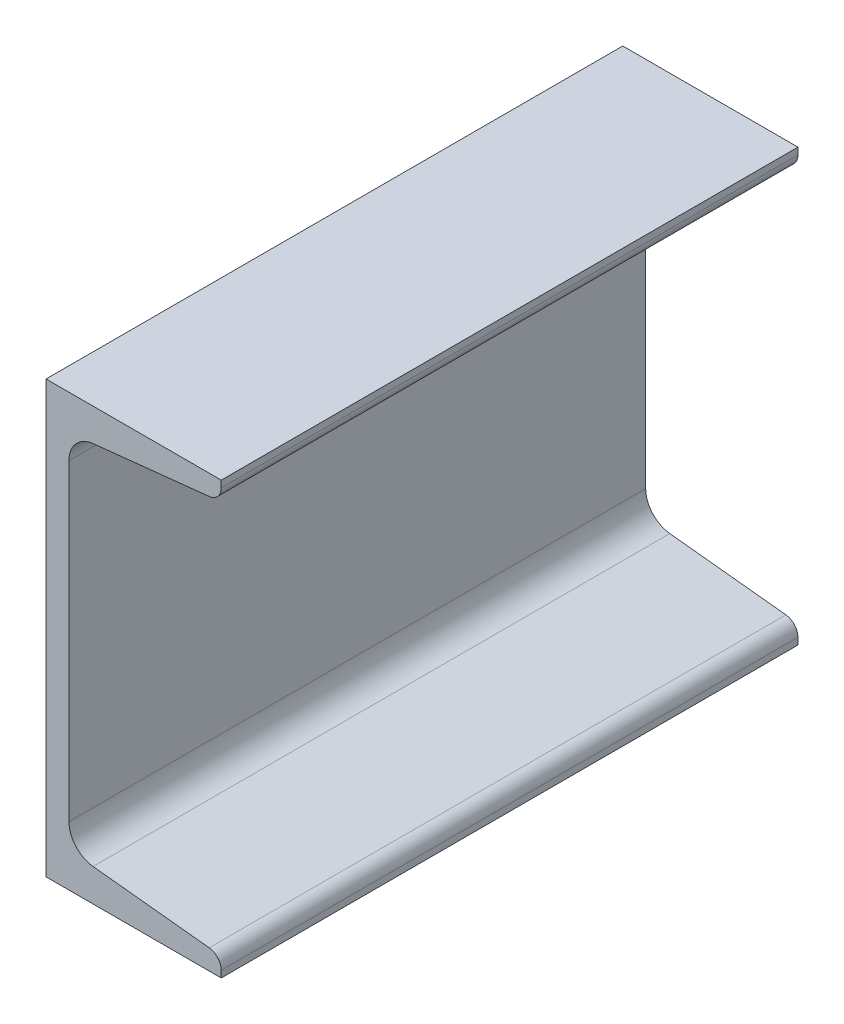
ISO-10303-21;
HEADER;
FILE_DESCRIPTION(('STEP AP214'),'2;1');
FILE_NAME('part.step','',(''),(''),'','','');
FILE_SCHEMA(('AUTOMOTIVE_DESIGN { 1 0 10303 214 1 1 1 1 }'));
ENDSEC;
DATA;
#1=APPLICATION_CONTEXT('core data for automotive mechanical design processes');
#2=APPLICATION_PROTOCOL_DEFINITION('international standard','automotive_design',2000,#1);
#3=PRODUCT_CONTEXT('',#1,'mechanical');
#4=PRODUCT('Part','Part','',(#3));
#5=PRODUCT_RELATED_PRODUCT_CATEGORY('part','',(#4));
#6=PRODUCT_DEFINITION_FORMATION('','',#4);
#7=PRODUCT_DEFINITION_CONTEXT('part definition',#1,'design');
#8=PRODUCT_DEFINITION('design','',#6,#7);
#9=PRODUCT_DEFINITION_SHAPE('','',#8);
#10=(LENGTH_UNIT() NAMED_UNIT(*) SI_UNIT(.MILLI.,.METRE.));
#11=(NAMED_UNIT(*) PLANE_ANGLE_UNIT() SI_UNIT($,.RADIAN.));
#12=(NAMED_UNIT(*) SI_UNIT($,.STERADIAN.) SOLID_ANGLE_UNIT());
#13=UNCERTAINTY_MEASURE_WITH_UNIT(LENGTH_MEASURE(1.E-05),#10,'distance_accuracy_value','');
#14=(GEOMETRIC_REPRESENTATION_CONTEXT(3) GLOBAL_UNCERTAINTY_ASSIGNED_CONTEXT((#13)) GLOBAL_UNIT_ASSIGNED_CONTEXT((#10,
#11,#12)) REPRESENTATION_CONTEXT('',''));
#15=CARTESIAN_POINT('',(0.,0.,0.));
#16=DIRECTION('',(0.,0.,1.));
#17=DIRECTION('',(1.,0.,0.));
#18=AXIS2_PLACEMENT_3D('',#15,#16,#17);
#19=CARTESIAN_POINT('',(65.,80.,214.));
#20=DIRECTION('',(0.,-1.,0.));
#21=DIRECTION('',(1.,0.,0.));
#22=AXIS2_PLACEMENT_3D('',#19,#20,#21);
#23=PLANE('',#22);
#24=DIRECTION('',(-1.,0.,0.));
#25=VECTOR('',#24,1.);
#26=CARTESIAN_POINT('',(65.,80.,0.));
#27=LINE('',#26,#25);
#28=CARTESIAN_POINT('',(65.,80.,0.));
#29=VERTEX_POINT('',#28);
#30=CARTESIAN_POINT('',(0.,80.,0.));
#31=VERTEX_POINT('',#30);
#32=EDGE_CURVE('E159',#29,#31,#27,.T.);
#33=ORIENTED_EDGE('',*,*,#32,.T.);
#34=DIRECTION('',(0.,0.,-1.));
#35=VECTOR('',#34,1.);
#36=CARTESIAN_POINT('',(0.,80.,214.));
#37=LINE('',#36,#35);
#38=CARTESIAN_POINT('',(0.,80.,214.));
#39=VERTEX_POINT('',#38);
#40=EDGE_CURVE('E11',#39,#31,#37,.T.);
#41=ORIENTED_EDGE('',*,*,#40,.F.);
#42=DIRECTION('',(-1.,0.,0.));
#43=VECTOR('',#42,1.);
#44=CARTESIAN_POINT('',(65.,80.,214.));
#45=LINE('',#44,#43);
#46=CARTESIAN_POINT('',(65.,80.,214.));
#47=VERTEX_POINT('',#46);
#48=EDGE_CURVE('E181',#47,#39,#45,.T.);
#49=ORIENTED_EDGE('',*,*,#48,.F.);
#50=DIRECTION('',(0.,0.,-1.));
#51=VECTOR('',#50,1.);
#52=CARTESIAN_POINT('',(65.,80.,214.));
#53=LINE('',#52,#51);
#54=EDGE_CURVE('E155',#47,#29,#53,.T.);
#55=ORIENTED_EDGE('',*,*,#54,.T.);
#56=EDGE_LOOP('',(#33,#41,#49,#55));
#57=FACE_BOUND('',#56,.T.);
#58=ADVANCED_FACE('F39',(#57),#23,.F.);
#59=CARTESIAN_POINT('',(0.,80.,214.));
#60=DIRECTION('',(1.,0.,0.));
#61=DIRECTION('',(0.,1.,0.));
#62=AXIS2_PLACEMENT_3D('',#59,#60,#61);
#63=PLANE('',#62);
#64=DIRECTION('',(0.,-1.,0.));
#65=VECTOR('',#64,1.);
#66=CARTESIAN_POINT('',(0.,80.,0.));
#67=LINE('',#66,#65);
#68=CARTESIAN_POINT('',(0.,-80.,0.));
#69=VERTEX_POINT('',#68);
#70=EDGE_CURVE('E162',#31,#69,#67,.T.);
#71=ORIENTED_EDGE('',*,*,#70,.T.);
#72=DIRECTION('',(0.,0.,-1.));
#73=VECTOR('',#72,1.);
#74=CARTESIAN_POINT('',(0.,-80.,214.));
#75=LINE('',#74,#73);
#76=CARTESIAN_POINT('',(0.,-80.,214.));
#77=VERTEX_POINT('',#76);
#78=EDGE_CURVE('E47',#77,#69,#75,.T.);
#79=ORIENTED_EDGE('',*,*,#78,.F.);
#80=DIRECTION('',(0.,-1.,0.));
#81=VECTOR('',#80,1.);
#82=CARTESIAN_POINT('',(0.,80.,214.));
#83=LINE('',#82,#81);
#84=EDGE_CURVE('E110',#39,#77,#83,.T.);
#85=ORIENTED_EDGE('',*,*,#84,.F.);
#86=ORIENTED_EDGE('',*,*,#40,.T.);
#87=EDGE_LOOP('',(#71,#79,#85,#86));
#88=FACE_BOUND('',#87,.T.);
#89=ADVANCED_FACE('F259',(#88),#63,.F.);
#90=CARTESIAN_POINT('',(0.,-80.,214.));
#91=DIRECTION('',(0.,1.,0.));
#92=DIRECTION('',(0.,0.,1.));
#93=AXIS2_PLACEMENT_3D('',#90,#91,#92);
#94=PLANE('',#93);
#95=DIRECTION('',(1.,0.,0.));
#96=VECTOR('',#95,1.);
#97=CARTESIAN_POINT('',(0.,-80.,0.));
#98=LINE('',#97,#96);
#99=CARTESIAN_POINT('',(65.,-80.,0.));
#100=VERTEX_POINT('',#99);
#101=EDGE_CURVE('E164',#69,#100,#98,.T.);
#102=ORIENTED_EDGE('',*,*,#101,.T.);
#103=DIRECTION('',(0.,0.,-1.));
#104=VECTOR('',#103,1.);
#105=CARTESIAN_POINT('',(65.,-80.,214.));
#106=LINE('',#105,#104);
#107=CARTESIAN_POINT('',(65.,-80.,214.));
#108=VERTEX_POINT('',#107);
#109=EDGE_CURVE('E200',#108,#100,#106,.T.);
#110=ORIENTED_EDGE('',*,*,#109,.F.);
#111=DIRECTION('',(1.,0.,0.));
#112=VECTOR('',#111,1.);
#113=CARTESIAN_POINT('',(0.,-80.,214.));
#114=LINE('',#113,#112);
#115=EDGE_CURVE('E208',#77,#108,#114,.T.);
#116=ORIENTED_EDGE('',*,*,#115,.F.);
#117=ORIENTED_EDGE('',*,*,#78,.T.);
#118=EDGE_LOOP('',(#102,#110,#116,#117));
#119=FACE_BOUND('',#118,.T.);
#120=ADVANCED_FACE('F206',(#119),#94,.F.);
#121=CARTESIAN_POINT('',(65.,-80.,214.));
#122=DIRECTION('',(-1.,0.,0.));
#123=DIRECTION('',(0.,0.,1.));
#124=AXIS2_PLACEMENT_3D('',#121,#122,#123);
#125=PLANE('',#124);
#126=DIRECTION('',(0.,1.,0.));
#127=VECTOR('',#126,1.);
#128=CARTESIAN_POINT('',(65.,-80.,0.));
#129=LINE('',#128,#127);
#130=CARTESIAN_POINT('',(65.,-77.4971407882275,0.));
#131=VERTEX_POINT('',#130);
#132=EDGE_CURVE('E166',#100,#131,#129,.T.);
#133=ORIENTED_EDGE('',*,*,#132,.T.);
#134=DIRECTION('',(0.,0.,-1.));
#135=VECTOR('',#134,1.);
#136=CARTESIAN_POINT('',(65.,-77.4971407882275,214.));
#137=LINE('',#136,#135);
#138=CARTESIAN_POINT('',(65.,-77.4971407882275,214.));
#139=VERTEX_POINT('',#138);
#140=EDGE_CURVE('E197',#139,#131,#137,.T.);
#141=ORIENTED_EDGE('',*,*,#140,.F.);
#142=DIRECTION('',(0.,1.,0.));
#143=VECTOR('',#142,1.);
#144=CARTESIAN_POINT('',(65.,-80.,214.));
#145=LINE('',#144,#143);
#146=EDGE_CURVE('E226',#108,#139,#145,.T.);
#147=ORIENTED_EDGE('',*,*,#146,.F.);
#148=ORIENTED_EDGE('',*,*,#109,.T.);
#149=EDGE_LOOP('',(#133,#141,#147,#148));
#150=FACE_BOUND('',#149,.T.);
#151=ADVANCED_FACE('F217',(#150),#125,.F.);
#152=CARTESIAN_POINT('',(60.,-77.4971407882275,214.));
#153=DIRECTION('',(0.,0.,-1.));
#154=DIRECTION('',(-1.,0.,0.));
#155=AXIS2_PLACEMENT_3D('',#152,#153,#154);
#156=CYLINDRICAL_SURFACE('',#155,5.);
#157=CARTESIAN_POINT('',(60.,-77.4971407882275,0.));
#158=DIRECTION('',(0.,0.,1.));
#159=DIRECTION('',(1.,0.,0.));
#160=AXIS2_PLACEMENT_3D('',#157,#158,#159);
#161=CIRCLE('',#160,5.);
#162=CARTESIAN_POINT('',(60.5280045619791,-72.5250978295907,0.));
#163=VERTEX_POINT('',#162);
#164=EDGE_CURVE('E168',#131,#163,#161,.T.);
#165=ORIENTED_EDGE('',*,*,#164,.T.);
#166=DIRECTION('',(0.,0.,-1.));
#167=VECTOR('',#166,1.);
#168=CARTESIAN_POINT('',(60.5280045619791,-72.5250978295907,214.));
#169=LINE('',#168,#167);
#170=CARTESIAN_POINT('',(60.5280045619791,-72.5250978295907,214.));
#171=VERTEX_POINT('',#170);
#172=EDGE_CURVE('E194',#171,#163,#169,.T.);
#173=ORIENTED_EDGE('',*,*,#172,.F.);
#174=CARTESIAN_POINT('',(60.,-77.4971407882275,214.));
#175=DIRECTION('',(0.,0.,1.));
#176=DIRECTION('',(1.,0.,0.));
#177=AXIS2_PLACEMENT_3D('',#174,#175,#176);
#178=CIRCLE('',#177,5.);
#179=EDGE_CURVE('E223',#139,#171,#178,.T.);
#180=ORIENTED_EDGE('',*,*,#179,.F.);
#181=ORIENTED_EDGE('',*,*,#140,.T.);
#182=EDGE_LOOP('',(#165,#173,#180,#181));
#183=FACE_BOUND('',#182,.T.);
#184=ADVANCED_FACE('F221',(#183),#156,.T.);
#185=CARTESIAN_POINT('',(60.5280045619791,-72.5250978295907,214.));
#186=DIRECTION('',(-0.105600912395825,-0.994408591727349,0.));
#187=DIRECTION('',(0.994408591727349,-0.105600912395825,0.));
#188=AXIS2_PLACEMENT_3D('',#185,#186,#187);
#189=PLANE('',#188);
#190=DIRECTION('',(-0.994408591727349,0.105600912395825,0.));
#191=VECTOR('',#190,1.);
#192=CARTESIAN_POINT('',(60.5280045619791,-72.5250978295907,0.));
#193=LINE('',#192,#191);
#194=CARTESIAN_POINT('',(17.4439908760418,-67.9498043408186,0.));
#195=VERTEX_POINT('',#194);
#196=EDGE_CURVE('E170',#163,#195,#193,.T.);
#197=ORIENTED_EDGE('',*,*,#196,.T.);
#198=DIRECTION('',(0.,0.,-1.));
#199=VECTOR('',#198,1.);
#200=CARTESIAN_POINT('',(17.4439908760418,-67.9498043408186,214.));
#201=LINE('',#200,#199);
#202=CARTESIAN_POINT('',(17.4439908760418,-67.9498043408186,214.));
#203=VERTEX_POINT('',#202);
#204=EDGE_CURVE('E191',#203,#195,#201,.T.);
#205=ORIENTED_EDGE('',*,*,#204,.F.);
#206=DIRECTION('',(-0.994408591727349,0.105600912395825,0.));
#207=VECTOR('',#206,1.);
#208=CARTESIAN_POINT('',(60.5280045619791,-72.5250978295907,214.));
#209=LINE('',#208,#207);
#210=EDGE_CURVE('E225',#171,#203,#209,.T.);
#211=ORIENTED_EDGE('',*,*,#210,.F.);
#212=ORIENTED_EDGE('',*,*,#172,.T.);
#213=EDGE_LOOP('',(#197,#205,#211,#212));
#214=FACE_BOUND('',#213,.T.);
#215=ADVANCED_FACE('F272',(#214),#189,.F.);
#216=CARTESIAN_POINT('',(18.5,-58.0057184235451,214.));
#217=DIRECTION('',(0.,0.,-1.));
#218=DIRECTION('',(-1.,0.,0.));
#219=AXIS2_PLACEMENT_3D('',#216,#217,#218);
#220=CYLINDRICAL_SURFACE('',#219,10.);
#221=CARTESIAN_POINT('',(18.5,-58.0057184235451,0.));
#222=DIRECTION('',(0.,0.,-1.));
#223=DIRECTION('',(-1.,0.,0.));
#224=AXIS2_PLACEMENT_3D('',#221,#222,#223);
#225=CIRCLE('',#224,10.);
#226=CARTESIAN_POINT('',(8.50000000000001,-58.005718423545,0.));
#227=VERTEX_POINT('',#226);
#228=EDGE_CURVE('E172',#195,#227,#225,.T.);
#229=ORIENTED_EDGE('',*,*,#228,.T.);
#230=DIRECTION('',(0.,0.,-1.));
#231=VECTOR('',#230,1.);
#232=CARTESIAN_POINT('',(8.50000000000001,-58.005718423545,214.));
#233=LINE('',#232,#231);
#234=CARTESIAN_POINT('',(8.50000000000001,-58.005718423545,214.));
#235=VERTEX_POINT('',#234);
#236=EDGE_CURVE('E188',#235,#227,#233,.T.);
#237=ORIENTED_EDGE('',*,*,#236,.F.);
#238=CARTESIAN_POINT('',(18.5,-58.0057184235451,214.));
#239=DIRECTION('',(0.,0.,-1.));
#240=DIRECTION('',(-1.,0.,0.));
#241=AXIS2_PLACEMENT_3D('',#238,#239,#240);
#242=CIRCLE('',#241,10.);
#243=EDGE_CURVE('E228',#203,#235,#242,.T.);
#244=ORIENTED_EDGE('',*,*,#243,.F.);
#245=ORIENTED_EDGE('',*,*,#204,.T.);
#246=EDGE_LOOP('',(#229,#237,#244,#245));
#247=FACE_BOUND('',#246,.T.);
#248=ADVANCED_FACE('F275',(#247),#220,.F.);
#249=CARTESIAN_POINT('',(8.50000000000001,-58.005718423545,214.));
#250=DIRECTION('',(-1.,0.,0.));
#251=DIRECTION('',(0.,0.,1.));
#252=AXIS2_PLACEMENT_3D('',#249,#250,#251);
#253=PLANE('',#252);
#254=DIRECTION('',(0.,1.,0.));
#255=VECTOR('',#254,1.);
#256=CARTESIAN_POINT('',(8.50000000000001,-58.005718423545,0.));
#257=LINE('',#256,#255);
#258=CARTESIAN_POINT('',(8.50000000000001,58.0057184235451,0.));
#259=VERTEX_POINT('',#258);
#260=EDGE_CURVE('E174',#227,#259,#257,.T.);
#261=ORIENTED_EDGE('',*,*,#260,.T.);
#262=DIRECTION('',(0.,0.,-1.));
#263=VECTOR('',#262,1.);
#264=CARTESIAN_POINT('',(8.50000000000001,58.0057184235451,214.));
#265=LINE('',#264,#263);
#266=CARTESIAN_POINT('',(8.50000000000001,58.0057184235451,214.));
#267=VERTEX_POINT('',#266);
#268=EDGE_CURVE('E185',#267,#259,#265,.T.);
#269=ORIENTED_EDGE('',*,*,#268,.F.);
#270=DIRECTION('',(0.,1.,0.));
#271=VECTOR('',#270,1.);
#272=CARTESIAN_POINT('',(8.50000000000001,-58.005718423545,214.));
#273=LINE('',#272,#271);
#274=EDGE_CURVE('E234',#235,#267,#273,.T.);
#275=ORIENTED_EDGE('',*,*,#274,.F.);
#276=ORIENTED_EDGE('',*,*,#236,.T.);
#277=EDGE_LOOP('',(#261,#269,#275,#276));
#278=FACE_BOUND('',#277,.T.);
#279=ADVANCED_FACE('F240',(#278),#253,.F.);
#280=CARTESIAN_POINT('',(18.5,58.0057184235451,214.));
#281=DIRECTION('',(0.,0.,-1.));
#282=DIRECTION('',(-1.,0.,0.));
#283=AXIS2_PLACEMENT_3D('',#280,#281,#282);
#284=CYLINDRICAL_SURFACE('',#283,10.);
#285=CARTESIAN_POINT('',(18.5,58.0057184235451,0.));
#286=DIRECTION('',(0.,0.,-1.));
#287=DIRECTION('',(-1.,0.,0.));
#288=AXIS2_PLACEMENT_3D('',#285,#286,#287);
#289=CIRCLE('',#288,10.);
#290=CARTESIAN_POINT('',(17.4439908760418,67.9498043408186,0.));
#291=VERTEX_POINT('',#290);
#292=EDGE_CURVE('E176',#259,#291,#289,.T.);
#293=ORIENTED_EDGE('',*,*,#292,.T.);
#294=DIRECTION('',(0.,0.,-1.));
#295=VECTOR('',#294,1.);
#296=CARTESIAN_POINT('',(17.4439908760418,67.9498043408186,214.));
#297=LINE('',#296,#295);
#298=CARTESIAN_POINT('',(17.4439908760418,67.9498043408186,214.));
#299=VERTEX_POINT('',#298);
#300=EDGE_CURVE('E150',#299,#291,#297,.T.);
#301=ORIENTED_EDGE('',*,*,#300,.F.);
#302=CARTESIAN_POINT('',(18.5,58.0057184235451,214.));
#303=DIRECTION('',(0.,0.,-1.));
#304=DIRECTION('',(-1.,0.,0.));
#305=AXIS2_PLACEMENT_3D('',#302,#303,#304);
#306=CIRCLE('',#305,10.);
#307=EDGE_CURVE('E141',#267,#299,#306,.T.);
#308=ORIENTED_EDGE('',*,*,#307,.F.);
#309=ORIENTED_EDGE('',*,*,#268,.T.);
#310=EDGE_LOOP('',(#293,#301,#308,#309));
#311=FACE_BOUND('',#310,.T.);
#312=ADVANCED_FACE('F244',(#311),#284,.F.);
#313=CARTESIAN_POINT('',(17.4439908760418,67.9498043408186,214.));
#314=DIRECTION('',(-0.105600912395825,0.994408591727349,0.));
#315=DIRECTION('',(-0.994408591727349,-0.105600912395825,0.));
#316=AXIS2_PLACEMENT_3D('',#313,#314,#315);
#317=PLANE('',#316);
#318=DIRECTION('',(0.994408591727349,0.105600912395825,0.));
#319=VECTOR('',#318,1.);
#320=CARTESIAN_POINT('',(17.4439908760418,67.9498043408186,0.));
#321=LINE('',#320,#319);
#322=CARTESIAN_POINT('',(60.5280045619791,72.5250978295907,0.));
#323=VERTEX_POINT('',#322);
#324=EDGE_CURVE('E149',#291,#323,#321,.T.);
#325=ORIENTED_EDGE('',*,*,#324,.T.);
#326=DIRECTION('',(0.,0.,-1.));
#327=VECTOR('',#326,1.);
#328=CARTESIAN_POINT('',(60.5280045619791,72.5250978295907,214.));
#329=LINE('',#328,#327);
#330=CARTESIAN_POINT('',(60.5280045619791,72.5250978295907,214.));
#331=VERTEX_POINT('',#330);
#332=EDGE_CURVE('E146',#331,#323,#329,.T.);
#333=ORIENTED_EDGE('',*,*,#332,.F.);
#334=DIRECTION('',(0.994408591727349,0.105600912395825,0.));
#335=VECTOR('',#334,1.);
#336=CARTESIAN_POINT('',(17.4439908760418,67.9498043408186,214.));
#337=LINE('',#336,#335);
#338=EDGE_CURVE('E135',#299,#331,#337,.T.);
#339=ORIENTED_EDGE('',*,*,#338,.F.);
#340=ORIENTED_EDGE('',*,*,#300,.T.);
#341=EDGE_LOOP('',(#325,#333,#339,#340));
#342=FACE_BOUND('',#341,.T.);
#343=ADVANCED_FACE('F147',(#342),#317,.F.);
#344=CARTESIAN_POINT('',(60.,77.4971407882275,214.));
#345=DIRECTION('',(0.,0.,-1.));
#346=DIRECTION('',(-1.,0.,0.));
#347=AXIS2_PLACEMENT_3D('',#344,#345,#346);
#348=CYLINDRICAL_SURFACE('',#347,5.);
#349=CARTESIAN_POINT('',(60.,77.4971407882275,0.));
#350=DIRECTION('',(0.,0.,1.));
#351=DIRECTION('',(1.,0.,0.));
#352=AXIS2_PLACEMENT_3D('',#349,#350,#351);
#353=CIRCLE('',#352,5.);
#354=CARTESIAN_POINT('',(65.,77.4971407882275,0.));
#355=VERTEX_POINT('',#354);
#356=EDGE_CURVE('E96',#323,#355,#353,.T.);
#357=ORIENTED_EDGE('',*,*,#356,.T.);
#358=DIRECTION('',(0.,0.,-1.));
#359=VECTOR('',#358,1.);
#360=CARTESIAN_POINT('',(65.,77.4971407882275,214.));
#361=LINE('',#360,#359);
#362=CARTESIAN_POINT('',(65.,77.4971407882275,214.));
#363=VERTEX_POINT('',#362);
#364=EDGE_CURVE('E151',#363,#355,#361,.T.);
#365=ORIENTED_EDGE('',*,*,#364,.F.);
#366=CARTESIAN_POINT('',(60.,77.4971407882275,214.));
#367=DIRECTION('',(0.,0.,1.));
#368=DIRECTION('',(1.,0.,0.));
#369=AXIS2_PLACEMENT_3D('',#366,#367,#368);
#370=CIRCLE('',#369,5.);
#371=EDGE_CURVE('E139',#331,#363,#370,.T.);
#372=ORIENTED_EDGE('',*,*,#371,.F.);
#373=ORIENTED_EDGE('',*,*,#332,.T.);
#374=EDGE_LOOP('',(#357,#365,#372,#373));
#375=FACE_BOUND('',#374,.T.);
#376=ADVANCED_FACE('F153',(#375),#348,.T.);
#377=CARTESIAN_POINT('',(65.,77.4971407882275,214.));
#378=DIRECTION('',(-1.,0.,0.));
#379=DIRECTION('',(0.,0.,1.));
#380=AXIS2_PLACEMENT_3D('',#377,#378,#379);
#381=PLANE('',#380);
#382=DIRECTION('',(0.,1.,0.));
#383=VECTOR('',#382,1.);
#384=CARTESIAN_POINT('',(65.,77.4971407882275,0.));
#385=LINE('',#384,#383);
#386=EDGE_CURVE('E102',#355,#29,#385,.T.);
#387=ORIENTED_EDGE('',*,*,#386,.T.);
#388=ORIENTED_EDGE('',*,*,#54,.F.);
#389=DIRECTION('',(0.,1.,0.));
#390=VECTOR('',#389,1.);
#391=CARTESIAN_POINT('',(65.,77.4971407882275,214.));
#392=LINE('',#391,#390);
#393=EDGE_CURVE('E55',#363,#47,#392,.T.);
#394=ORIENTED_EDGE('',*,*,#393,.F.);
#395=ORIENTED_EDGE('',*,*,#364,.T.);
#396=EDGE_LOOP('',(#387,#388,#394,#395));
#397=FACE_BOUND('',#396,.T.);
#398=ADVANCED_FACE('F248',(#397),#381,.F.);
#399=CARTESIAN_POINT('',(60.,-77.4971407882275,214.));
#400=DIRECTION('',(0.,0.,1.));
#401=DIRECTION('',(1.,0.,0.));
#402=AXIS2_PLACEMENT_3D('',#399,#400,#401);
#403=PLANE('',#402);
#404=ORIENTED_EDGE('',*,*,#48,.T.);
#405=ORIENTED_EDGE('',*,*,#84,.T.);
#406=ORIENTED_EDGE('',*,*,#115,.T.);
#407=ORIENTED_EDGE('',*,*,#146,.T.);
#408=ORIENTED_EDGE('',*,*,#179,.T.);
#409=ORIENTED_EDGE('',*,*,#210,.T.);
#410=ORIENTED_EDGE('',*,*,#243,.T.);
#411=ORIENTED_EDGE('',*,*,#274,.T.);
#412=ORIENTED_EDGE('',*,*,#307,.T.);
#413=ORIENTED_EDGE('',*,*,#338,.T.);
#414=ORIENTED_EDGE('',*,*,#371,.T.);
#415=ORIENTED_EDGE('',*,*,#393,.T.);
#416=EDGE_LOOP('',(#404,#405,#406,#407,#408,#409,#410,#411,#412,#413,#414,#415));
#417=FACE_BOUND('',#416,.T.);
#418=ADVANCED_FACE('F137',(#417),#403,.T.);
#419=CARTESIAN_POINT('',(60.,-77.4971407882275,0.));
#420=DIRECTION('',(0.,0.,1.));
#421=DIRECTION('',(1.,0.,0.));
#422=AXIS2_PLACEMENT_3D('',#419,#420,#421);
#423=PLANE('',#422);
#424=ORIENTED_EDGE('',*,*,#32,.F.);
#425=ORIENTED_EDGE('',*,*,#386,.F.);
#426=ORIENTED_EDGE('',*,*,#356,.F.);
#427=ORIENTED_EDGE('',*,*,#324,.F.);
#428=ORIENTED_EDGE('',*,*,#292,.F.);
#429=ORIENTED_EDGE('',*,*,#260,.F.);
#430=ORIENTED_EDGE('',*,*,#228,.F.);
#431=ORIENTED_EDGE('',*,*,#196,.F.);
#432=ORIENTED_EDGE('',*,*,#164,.F.);
#433=ORIENTED_EDGE('',*,*,#132,.F.);
#434=ORIENTED_EDGE('',*,*,#101,.F.);
#435=ORIENTED_EDGE('',*,*,#70,.F.);
#436=EDGE_LOOP('',(#424,#425,#426,#427,#428,#429,#430,#431,#432,#433,#434,#435));
#437=FACE_BOUND('',#436,.T.);
#438=ADVANCED_FACE('F212',(#437),#423,.F.);
#439=CLOSED_SHELL('',(#58,#89,#120,#151,#184,#215,#248,#279,#312,#343,#376,#398,#418,#438));
#440=MANIFOLD_SOLID_BREP('B2',#439);
#441=ADVANCED_BREP_SHAPE_REPRESENTATION('',(#18,#440),#14);
#442=SHAPE_DEFINITION_REPRESENTATION(#9,#441);
ENDSEC;
END-ISO-10303-21;
